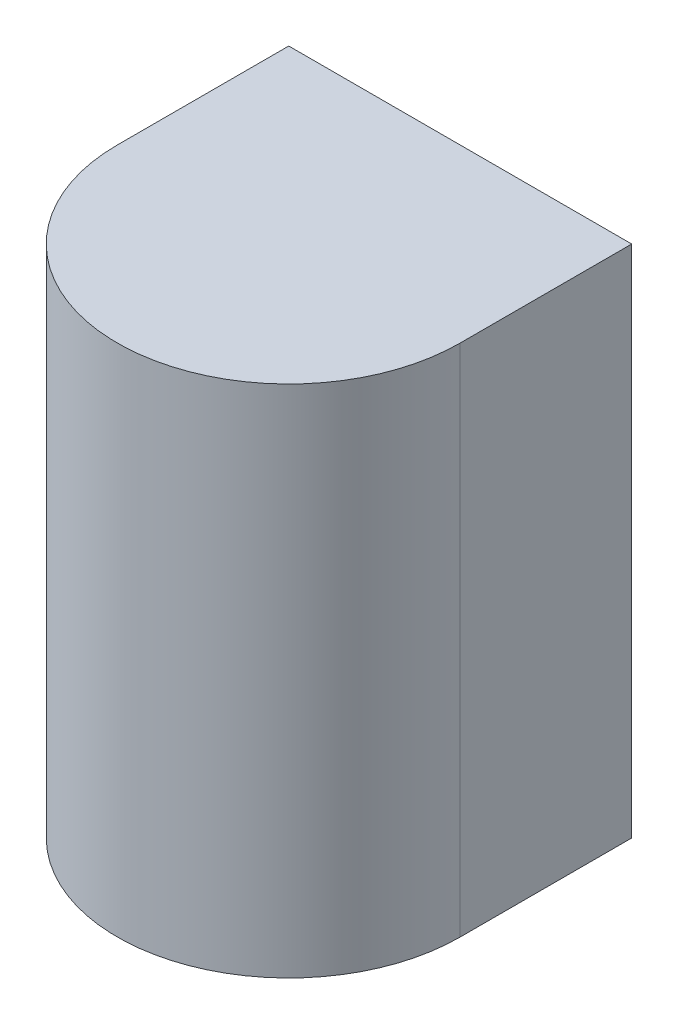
from build123d import *

# Parameters (mm, degrees)
BOSS_EXTRUDE1_DEPTH = 304.8
SKETCH2_R           = 20.32
SKETCH2_R_2         = 12.7
BOSS_EXTRUDE2_DEPTH = 16.764


with BuildPart() as part:
    # Sketch1 → Boss-Extrude1 (new body)
    with BuildSketch(Plane(origin=(0, 0, 0), x_dir=(1, 0, 0), z_dir=(0, 1, 0))):
        with BuildLine():
            Line((101.6, 101.6), (-101.6, 101.6))
            Line((-101.6, 101.6), (-101.6, 0))
            ThreePointArc((-101.6, 0), (0, -101.6), (101.6, 0))
            Line((101.6, 0), (101.6, 101.6))
        make_face()
    extrude(amount=-BOSS_EXTRUDE1_DEPTH)

    # Sketch2 → Boss-Extrude2 (add)
    with BuildSketch(Plane.XZ.offset(304.8)):
        with Locations(Location((0, 0, 0), (0, 0, 90))):
            Circle(SKETCH2_R)
        with Locations(Location((0, 0, 0), (0, 0, 270))):
            Circle(SKETCH2_R_2, mode=Mode.SUBTRACT)
    extrude(amount=BOSS_EXTRUDE2_DEPTH)


solid = part.part
